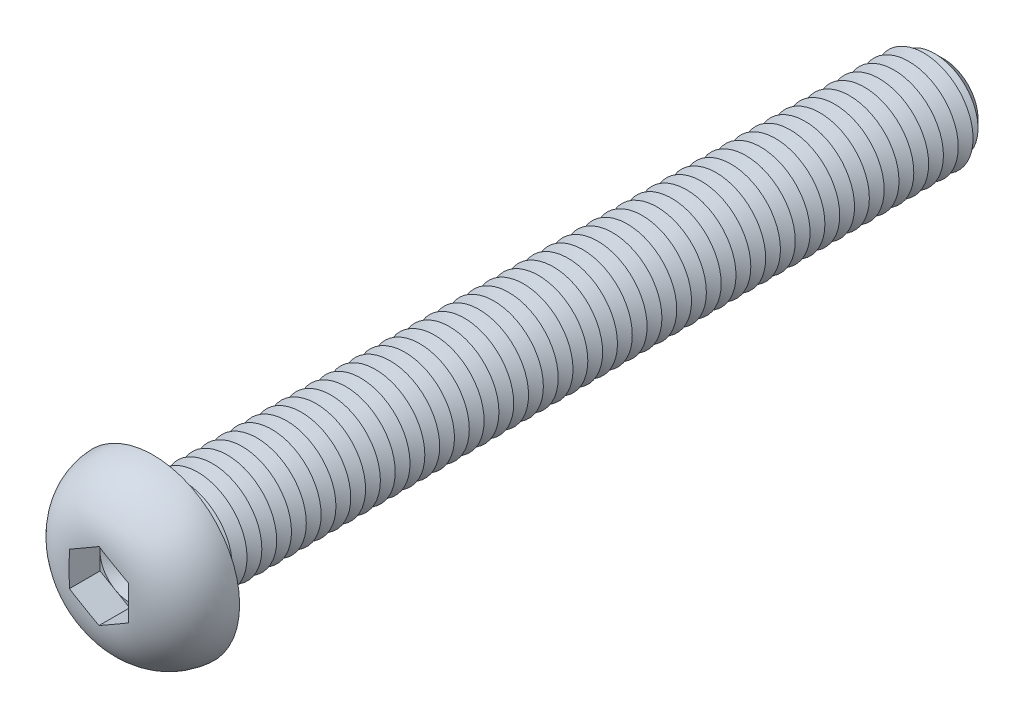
from build123d import *

# Parameters (mm, degrees)
CUT_EXTRUDE1_DEPTH  = 3.12
SKETCH4_R           = 5
BOSS_EXTRUDE1_DEPTH = 80
CHAMFER1_SIZE       = 1.5
LPATTERN1_COUNT     = 52
LPATTERN1_PITCH     = 1.5
FILLET2_R           = 0.6


with BuildPart() as part:
    # Sketch2 → Revolve1 (revolve)
    with BuildSketch(Plane(origin=(0, 0, 0), x_dir=(0, 0, -1), z_dir=(1, 0, 0)), mode=Mode.PRIVATE) as revolve1_sk:
        with BuildLine():
            Line((0, 0), (-5.5, 0))
            Line((-5.5, 0), (-5.5, 2.957763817))
            ThreePointArc((-5.5, 2.957763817), (-3.905948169, 6.951508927), (0, 8.75))
            Line((0, 8.75), (0, 0))
        make_face()
    revolve(revolve1_sk.sketch.rotate(Axis((0, 0, 47.934239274), (0, 0, -1)), 90), axis=Axis((0, 0, 47.934239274), (0, 0, -1)))

    # Sketch3 → Cut-Extrude1 (cut)
    with BuildSketch(Plane.XY.offset(5.5)):
        Polygon((0, 3.464101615), (-3, 1.732050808), (-3, -1.732050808), (0, -3.464101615), (3, -1.732050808), (3, 1.732050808), align=None)
    extrude(amount=-CUT_EXTRUDE1_DEPTH, mode=Mode.SUBTRACT)

    # Sketch4 → Boss-Extrude1 (add)
    with BuildSketch(Plane(origin=(0, 0, 0), x_dir=(-1, 0, 0), z_dir=(0, 0, -1))):
        with Locations(Location((0, 0, 0), (0, 0, 180))):
            Circle(SKETCH4_R)
    extrude(amount=BOSS_EXTRUDE1_DEPTH)

    # Chamfer1
    chamfer1_edges = [part.edges().sort_by_distance(p)[0] for p in [
        (-5, 0, -80),
    ]]
    chamfer(chamfer1_edges, length=CHAMFER1_SIZE)

    # Sketch5 → Cut-Revolve1 (revolve, cut)
    with BuildSketch(Plane(origin=(0, 0, 0), x_dir=(0, 0, -1), z_dir=(1, 0, 0)), mode=Mode.PRIVATE) as cut_revolve1_sk:
        Polygon((1.5, 5), (3, 5), (2.25, 3.700961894), align=None)
    cut_revolve1 = revolve(cut_revolve1_sk.sketch.rotate(Axis((0, 0, 47.934239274), (0, 0, -1)), 90), axis=Axis((0, 0, 47.934239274), (0, 0, -1)), mode=Mode.SUBTRACT)

    # LPattern1: Cut-Revolve1 ×52
    with Locations(*[(0, 0, -i * LPATTERN1_PITCH) for i in range(1, LPATTERN1_COUNT)]):
        add(cut_revolve1, mode=Mode.SUBTRACT)

    # Fillet2
    fillet2_edges = [part.edges().sort_by_distance(p)[0] for p in [
        (-5, 0, 0),
    ]]
    fillet(fillet2_edges, radius=FILLET2_R)

    # Cut-Extrude2 cone 1 section (on through the dimple's axis) → Cut-Extrude2 (revolve, cut)
    with BuildSketch(Plane(origin=(0, 0, 2.38), x_dir=(0, -1, 0), z_dir=(1, 0, 0))):
        Polygon((0, 0), (3, 0), (0, 1.732050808), align=None)
    revolve(axis=Axis((0, 0, 2.38), (0, 0, -1)), mode=Mode.SUBTRACT)


solid = part.part
